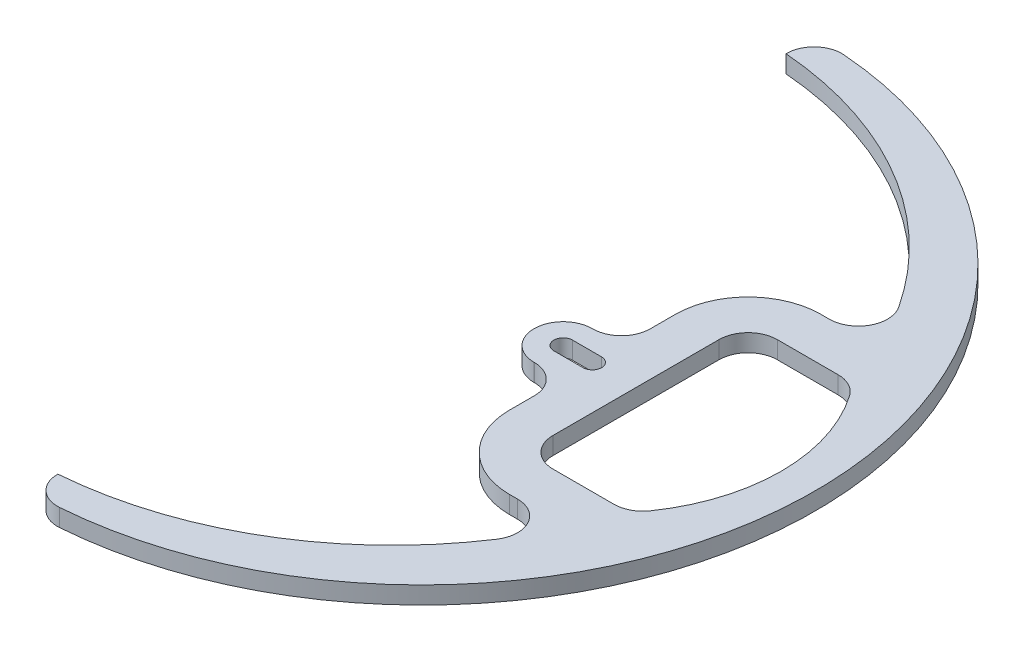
from build123d import *

# Parameters (mm, degrees)
EXTRUSION1_DEPTH = 6


with BuildPart() as part:
    # Esquisse1 → Extrusion1 (new body)
    with BuildSketch(Plane(origin=(0, 0, 0), x_dir=(1, 0, 0), z_dir=(0, 1, 0))):
        with BuildLine():
            Line((98.5, 10), (98.6, 10))
            ThreePointArc((98.6, 10), (105.600357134, 12.899642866), (108.5, 19.9))
            Line((108.5, 19.9), (108.5, 28.5))
            ThreePointArc((108.5, 28.5), (115.82233047, 46.17766953), (133.5, 53.5))
            Line((133.5, 53.5), (136.357473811, 53.5))
            ThreePointArc((136.357473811, 53.5), (145.161629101, 58.757969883), (144.707387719, 69.002630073))
            ThreePointArc((144.707387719, 69.002630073), (103.822978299, 107.942704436), (50, 125))
            Line((50, 125), (50, 125.139921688))
            ThreePointArc((50, 125.139921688), (53.041736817, 132.10704711), (60.219123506, 134.612664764))
            ThreePointArc((60.219123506, 134.612664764), (185, 0), (60.219123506, -134.612664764))
            ThreePointArc((60.219123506, -134.612664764), (53.041736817, -132.10704711), (50, -125.139921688))
            Line((50, -125.139921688), (50, -125))
            ThreePointArc((50, -125), (103.822978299, -107.942704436), (144.707387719, -69.002630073))
            ThreePointArc((144.707387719, -69.002630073), (145.161629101, -58.757969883), (136.357473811, -53.5))
            Line((136.357473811, -53.5), (133.5, -53.5))
            ThreePointArc((133.5, -53.5), (115.82233047, -46.17766953), (108.5, -28.5))
            Line((108.5, -28.5), (108.5, -19.9))
            ThreePointArc((108.5, -19.9), (105.600357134, -12.899642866), (98.6, -10))
            Line((98.6, -10), (98.5, -10))
            ThreePointArc((98.5, -10), (88.5, 0), (98.5, 10))
        make_face()
        with BuildLine():
            Line((154.406209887, 38.5), (133.5, 38.5))
            ThreePointArc((133.5, 38.5), (126.428932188, 35.571067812), (123.5, 28.5))
            Line((123.5, 28.5), (123.5, -28.5))
            ThreePointArc((123.5, -28.5), (126.428932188, -35.571067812), (133.5, -38.5))
            Line((133.5, -38.5), (154.406209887, -38.5))
            ThreePointArc((154.406209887, -38.5), (159.043019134, -37.360022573), (162.622656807, -34.2))
            ThreePointArc((162.622656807, -34.2), (173.323975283, 0), (162.622656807, 34.2))
            ThreePointArc((162.622656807, 34.2), (159.043019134, 37.360022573), (154.406209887, 38.5))
        make_face(mode=Mode.SUBTRACT)
        with BuildLine():
            Line((98.5, 3.2), (108.5, 3.2))
            ThreePointArc((108.5, 3.2), (111.7, 0), (108.5, -3.2))
            Line((108.5, -3.2), (98.5, -3.2))
            ThreePointArc((98.5, -3.2), (95.3, 0), (98.5, 3.2))
        make_face(mode=Mode.SUBTRACT)
    extrude(amount=EXTRUSION1_DEPTH)


solid = part.part
